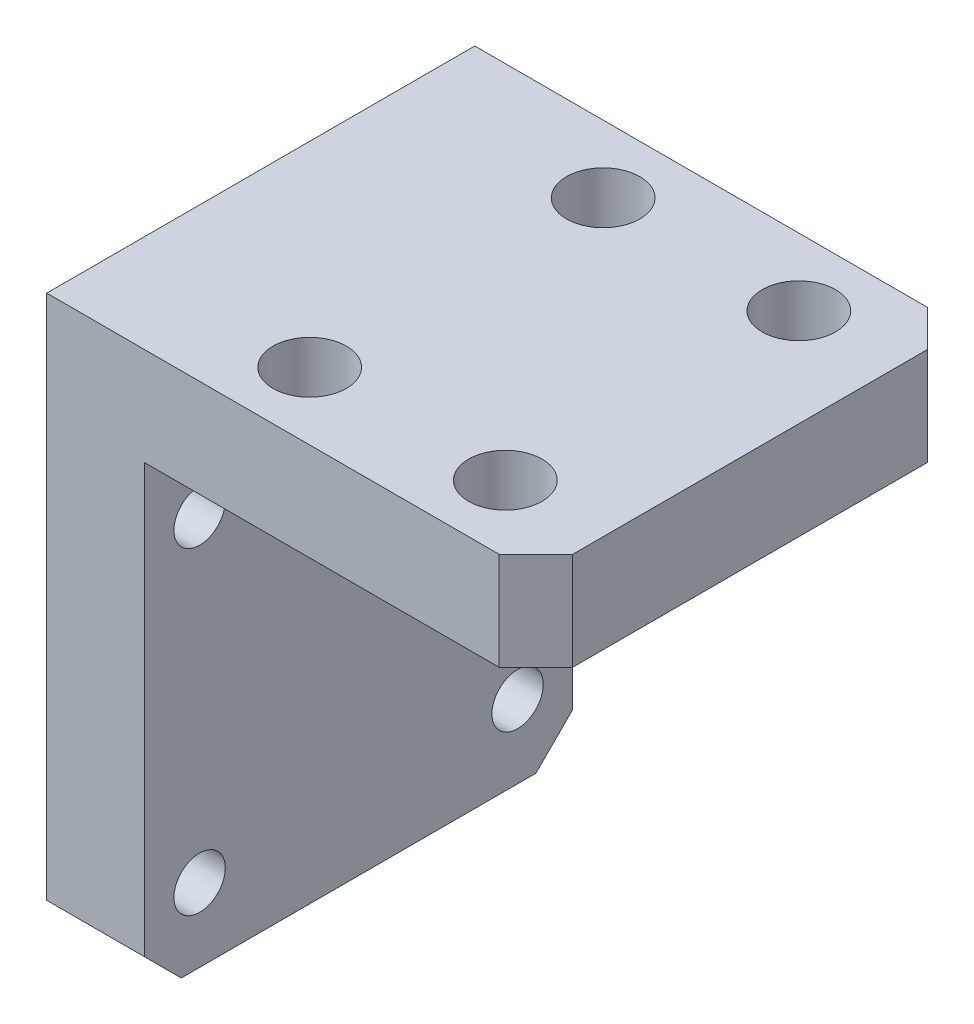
ISO-10303-21;
HEADER;
FILE_DESCRIPTION(('STEP AP214'),'2;1');
FILE_NAME('part.step','',(''),(''),'','','');
FILE_SCHEMA(('AUTOMOTIVE_DESIGN { 1 0 10303 214 1 1 1 1 }'));
ENDSEC;
DATA;
#1=APPLICATION_CONTEXT('core data for automotive mechanical design processes');
#2=APPLICATION_PROTOCOL_DEFINITION('international standard','automotive_design',2000,#1);
#3=PRODUCT_CONTEXT('',#1,'mechanical');
#4=PRODUCT('Part','Part','',(#3));
#5=PRODUCT_RELATED_PRODUCT_CATEGORY('part','',(#4));
#6=PRODUCT_DEFINITION_FORMATION('','',#4);
#7=PRODUCT_DEFINITION_CONTEXT('part definition',#1,'design');
#8=PRODUCT_DEFINITION('design','',#6,#7);
#9=PRODUCT_DEFINITION_SHAPE('','',#8);
#10=(LENGTH_UNIT() NAMED_UNIT(*) SI_UNIT(.MILLI.,.METRE.));
#11=(NAMED_UNIT(*) PLANE_ANGLE_UNIT() SI_UNIT($,.RADIAN.));
#12=(NAMED_UNIT(*) SI_UNIT($,.STERADIAN.) SOLID_ANGLE_UNIT());
#13=UNCERTAINTY_MEASURE_WITH_UNIT(LENGTH_MEASURE(1.E-05),#10,'distance_accuracy_value','');
#14=(GEOMETRIC_REPRESENTATION_CONTEXT(3) GLOBAL_UNCERTAINTY_ASSIGNED_CONTEXT((#13)) GLOBAL_UNIT_ASSIGNED_CONTEXT((#10,
#11,#12)) REPRESENTATION_CONTEXT('',''));
#15=CARTESIAN_POINT('',(0.,0.,0.));
#16=DIRECTION('',(0.,0.,1.));
#17=DIRECTION('',(1.,0.,0.));
#18=AXIS2_PLACEMENT_3D('',#15,#16,#17);
#19=CARTESIAN_POINT('',(0.,0.,35.));
#20=DIRECTION('',(-1.,0.,0.));
#21=DIRECTION('',(0.,0.,1.));
#22=AXIS2_PLACEMENT_3D('',#19,#20,#21);
#23=PLANE('',#22);
#24=DIRECTION('',(0.,0.,-1.));
#25=VECTOR('',#24,1.);
#26=CARTESIAN_POINT('',(0.,0.,35.));
#27=LINE('',#26,#25);
#28=CARTESIAN_POINT('',(0.,0.,32.));
#29=VERTEX_POINT('',#28);
#30=CARTESIAN_POINT('',(0.,0.,3.00000000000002));
#31=VERTEX_POINT('',#30);
#32=EDGE_CURVE('E151',#29,#31,#27,.T.);
#33=ORIENTED_EDGE('',*,*,#32,.T.);
#34=DIRECTION('',(0.,1.,0.));
#35=VECTOR('',#34,1.);
#36=CARTESIAN_POINT('',(0.,8.,3.00000000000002));
#37=LINE('',#36,#35);
#38=CARTESIAN_POINT('',(0.,8.,3.00000000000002));
#39=VERTEX_POINT('',#38);
#40=EDGE_CURVE('E216',#31,#39,#37,.T.);
#41=ORIENTED_EDGE('',*,*,#40,.T.);
#42=DIRECTION('',(0.,0.,-1.));
#43=VECTOR('',#42,1.);
#44=CARTESIAN_POINT('',(0.,8.,35.));
#45=LINE('',#44,#43);
#46=CARTESIAN_POINT('',(0.,8.,32.));
#47=VERTEX_POINT('',#46);
#48=EDGE_CURVE('E137',#47,#39,#45,.T.);
#49=ORIENTED_EDGE('',*,*,#48,.F.);
#50=DIRECTION('',(0.,-1.,0.));
#51=VECTOR('',#50,1.);
#52=CARTESIAN_POINT('',(0.,0.,32.));
#53=LINE('',#52,#51);
#54=EDGE_CURVE('E57',#47,#29,#53,.T.);
#55=ORIENTED_EDGE('',*,*,#54,.T.);
#56=EDGE_LOOP('',(#33,#41,#49,#55));
#57=FACE_BOUND('',#56,.T.);
#58=ADVANCED_FACE('F36',(#57),#23,.F.);
#59=CARTESIAN_POINT('',(-40.,8.,35.));
#60=DIRECTION('',(0.,-1.,0.));
#61=DIRECTION('',(0.,0.,-1.));
#62=AXIS2_PLACEMENT_3D('',#59,#60,#61);
#63=PLANE('',#62);
#64=CARTESIAN_POINT('',(-8.,8.,29.5));
#65=DIRECTION('',(0.,1.,0.));
#66=DIRECTION('',(0.,0.,-1.));
#67=AXIS2_PLACEMENT_3D('',#64,#65,#66);
#68=CIRCLE('',#67,3.);
#69=CARTESIAN_POINT('',(-8.,8.,26.5));
#70=VERTEX_POINT('',#69);
#71=EDGE_CURVE('E177',#70,#70,#68,.T.);
#72=ORIENTED_EDGE('',*,*,#71,.F.);
#73=EDGE_LOOP('',(#72));
#74=FACE_BOUND('',#73,.T.);
#75=CARTESIAN_POINT('',(-8.,8.,5.50000000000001));
#76=DIRECTION('',(0.,1.,0.));
#77=DIRECTION('',(0.,0.,1.));
#78=AXIS2_PLACEMENT_3D('',#75,#76,#77);
#79=CIRCLE('',#78,3.);
#80=CARTESIAN_POINT('',(-8.,8.,8.50000000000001));
#81=VERTEX_POINT('',#80);
#82=EDGE_CURVE('E345',#81,#81,#79,.T.);
#83=ORIENTED_EDGE('',*,*,#82,.F.);
#84=EDGE_LOOP('',(#83));
#85=FACE_BOUND('',#84,.T.);
#86=CARTESIAN_POINT('',(-24.,8.,5.5));
#87=DIRECTION('',(0.,1.,0.));
#88=DIRECTION('',(0.,0.,-1.));
#89=AXIS2_PLACEMENT_3D('',#86,#87,#88);
#90=CIRCLE('',#89,3.);
#91=CARTESIAN_POINT('',(-24.,8.,2.5));
#92=VERTEX_POINT('',#91);
#93=EDGE_CURVE('E196',#92,#92,#90,.T.);
#94=ORIENTED_EDGE('',*,*,#93,.F.);
#95=EDGE_LOOP('',(#94));
#96=FACE_BOUND('',#95,.T.);
#97=CARTESIAN_POINT('',(-24.,8.,29.5));
#98=DIRECTION('',(0.,1.,0.));
#99=DIRECTION('',(0.,0.,1.));
#100=AXIS2_PLACEMENT_3D('',#97,#98,#99);
#101=CIRCLE('',#100,3.);
#102=CARTESIAN_POINT('',(-24.,8.,32.5));
#103=VERTEX_POINT('',#102);
#104=EDGE_CURVE('E172',#103,#103,#101,.T.);
#105=ORIENTED_EDGE('',*,*,#104,.F.);
#106=EDGE_LOOP('',(#105));
#107=FACE_BOUND('',#106,.T.);
#108=ORIENTED_EDGE('',*,*,#48,.T.);
#109=DIRECTION('',(-0.707106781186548,0.,-0.707106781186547));
#110=VECTOR('',#109,1.);
#111=CARTESIAN_POINT('',(0.,8.,3.00000000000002));
#112=LINE('',#111,#110);
#113=CARTESIAN_POINT('',(-3.00000000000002,8.,0.));
#114=VERTEX_POINT('',#113);
#115=EDGE_CURVE('E221',#39,#114,#112,.T.);
#116=ORIENTED_EDGE('',*,*,#115,.T.);
#117=DIRECTION('',(-1.,0.,0.));
#118=VECTOR('',#117,1.);
#119=CARTESIAN_POINT('',(-40.,8.,0.));
#120=LINE('',#119,#118);
#121=CARTESIAN_POINT('',(-40.,8.,0.));
#122=VERTEX_POINT('',#121);
#123=EDGE_CURVE('E133',#114,#122,#120,.T.);
#124=ORIENTED_EDGE('',*,*,#123,.T.);
#125=DIRECTION('',(0.,0.,-1.));
#126=VECTOR('',#125,1.);
#127=CARTESIAN_POINT('',(-40.,8.,35.));
#128=LINE('',#127,#126);
#129=CARTESIAN_POINT('',(-40.,8.,35.));
#130=VERTEX_POINT('',#129);
#131=EDGE_CURVE('E129',#130,#122,#128,.T.);
#132=ORIENTED_EDGE('',*,*,#131,.F.);
#133=DIRECTION('',(-1.,0.,0.));
#134=VECTOR('',#133,1.);
#135=CARTESIAN_POINT('',(-40.,8.,35.));
#136=LINE('',#135,#134);
#137=CARTESIAN_POINT('',(-3.00000000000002,8.,35.));
#138=VERTEX_POINT('',#137);
#139=EDGE_CURVE('E115',#138,#130,#136,.T.);
#140=ORIENTED_EDGE('',*,*,#139,.F.);
#141=DIRECTION('',(-0.707106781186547,0.,0.707106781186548));
#142=VECTOR('',#141,1.);
#143=CARTESIAN_POINT('',(-3.00000000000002,8.,35.));
#144=LINE('',#143,#142);
#145=EDGE_CURVE('E219',#138,#47,#144,.F.);
#146=ORIENTED_EDGE('',*,*,#145,.T.);
#147=EDGE_LOOP('',(#108,#116,#124,#132,#140,#146));
#148=FACE_BOUND('',#147,.T.);
#149=ADVANCED_FACE('F131',(#74,#85,#96,#107,#148),#63,.F.);
#150=CARTESIAN_POINT('',(-40.,8.,35.));
#151=DIRECTION('',(1.,0.,0.));
#152=DIRECTION('',(0.,1.,0.));
#153=AXIS2_PLACEMENT_3D('',#150,#151,#152);
#154=PLANE('',#153);
#155=CARTESIAN_POINT('',(-40.,-6.,4.50000000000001));
#156=DIRECTION('',(-1.,0.,0.));
#157=DIRECTION('',(0.,0.,-1.));
#158=AXIS2_PLACEMENT_3D('',#155,#156,#157);
#159=CIRCLE('',#158,2.1);
#160=CARTESIAN_POINT('',(-40.,-6.,2.40000000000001));
#161=VERTEX_POINT('',#160);
#162=EDGE_CURVE('E338',#161,#161,#159,.T.);
#163=ORIENTED_EDGE('',*,*,#162,.F.);
#164=EDGE_LOOP('',(#163));
#165=FACE_BOUND('',#164,.T.);
#166=CARTESIAN_POINT('',(-40.,-6.,30.5));
#167=DIRECTION('',(-1.,0.,0.));
#168=DIRECTION('',(0.,0.,1.));
#169=AXIS2_PLACEMENT_3D('',#166,#167,#168);
#170=CIRCLE('',#169,2.1);
#171=CARTESIAN_POINT('',(-40.,-6.,32.6));
#172=VERTEX_POINT('',#171);
#173=EDGE_CURVE('E333',#172,#172,#170,.T.);
#174=ORIENTED_EDGE('',*,*,#173,.F.);
#175=EDGE_LOOP('',(#174));
#176=FACE_BOUND('',#175,.T.);
#177=CARTESIAN_POINT('',(-40.,-32.,30.5));
#178=DIRECTION('',(-1.,0.,0.));
#179=DIRECTION('',(0.,0.,-1.));
#180=AXIS2_PLACEMENT_3D('',#177,#178,#179);
#181=CIRCLE('',#180,2.1);
#182=CARTESIAN_POINT('',(-40.,-32.,28.4));
#183=VERTEX_POINT('',#182);
#184=EDGE_CURVE('E326',#183,#183,#181,.T.);
#185=ORIENTED_EDGE('',*,*,#184,.F.);
#186=EDGE_LOOP('',(#185));
#187=FACE_BOUND('',#186,.T.);
#188=CARTESIAN_POINT('',(-40.,-32.,4.50000000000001));
#189=DIRECTION('',(-1.,0.,0.));
#190=DIRECTION('',(0.,0.,1.));
#191=AXIS2_PLACEMENT_3D('',#188,#189,#190);
#192=CIRCLE('',#191,2.1);
#193=CARTESIAN_POINT('',(-40.,-32.,6.60000000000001));
#194=VERTEX_POINT('',#193);
#195=EDGE_CURVE('E187',#194,#194,#192,.T.);
#196=ORIENTED_EDGE('',*,*,#195,.F.);
#197=EDGE_LOOP('',(#196));
#198=FACE_BOUND('',#197,.T.);
#199=DIRECTION('',(0.,-1.,0.));
#200=VECTOR('',#199,1.);
#201=CARTESIAN_POINT('',(-40.,8.,0.));
#202=LINE('',#201,#200);
#203=CARTESIAN_POINT('',(-40.,-35.,0.));
#204=VERTEX_POINT('',#203);
#205=EDGE_CURVE('E153',#122,#204,#202,.T.);
#206=ORIENTED_EDGE('',*,*,#205,.T.);
#207=DIRECTION('',(0.,-0.707106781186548,0.707106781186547));
#208=VECTOR('',#207,1.);
#209=CARTESIAN_POINT('',(-40.,-38.,3.00000000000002));
#210=LINE('',#209,#208);
#211=CARTESIAN_POINT('',(-40.,-38.,3.00000000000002));
#212=VERTEX_POINT('',#211);
#213=EDGE_CURVE('E210',#204,#212,#210,.T.);
#214=ORIENTED_EDGE('',*,*,#213,.T.);
#215=DIRECTION('',(0.,0.,-1.));
#216=VECTOR('',#215,1.);
#217=CARTESIAN_POINT('',(-40.,-38.,35.));
#218=LINE('',#217,#216);
#219=CARTESIAN_POINT('',(-40.,-38.,32.));
#220=VERTEX_POINT('',#219);
#221=EDGE_CURVE('E138',#220,#212,#218,.T.);
#222=ORIENTED_EDGE('',*,*,#221,.F.);
#223=DIRECTION('',(0.,-0.707106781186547,-0.707106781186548));
#224=VECTOR('',#223,1.);
#225=CARTESIAN_POINT('',(-40.,-35.,35.));
#226=LINE('',#225,#224);
#227=CARTESIAN_POINT('',(-40.,-35.,35.));
#228=VERTEX_POINT('',#227);
#229=EDGE_CURVE('E143',#220,#228,#226,.F.);
#230=ORIENTED_EDGE('',*,*,#229,.T.);
#231=DIRECTION('',(0.,-1.,0.));
#232=VECTOR('',#231,1.);
#233=CARTESIAN_POINT('',(-40.,8.,35.));
#234=LINE('',#233,#232);
#235=EDGE_CURVE('E120',#130,#228,#234,.T.);
#236=ORIENTED_EDGE('',*,*,#235,.F.);
#237=ORIENTED_EDGE('',*,*,#131,.T.);
#238=EDGE_LOOP('',(#206,#214,#222,#230,#236,#237));
#239=FACE_BOUND('',#238,.T.);
#240=ADVANCED_FACE('F140',(#165,#176,#187,#198,#239),#154,.F.);
#241=CARTESIAN_POINT('',(-40.,-38.,35.));
#242=DIRECTION('',(0.,1.,0.));
#243=DIRECTION('',(-1.,0.,0.));
#244=AXIS2_PLACEMENT_3D('',#241,#242,#243);
#245=PLANE('',#244);
#246=ORIENTED_EDGE('',*,*,#221,.T.);
#247=DIRECTION('',(1.,0.,0.));
#248=VECTOR('',#247,1.);
#249=CARTESIAN_POINT('',(-32.,-38.,3.00000000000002));
#250=LINE('',#249,#248);
#251=CARTESIAN_POINT('',(-32.,-38.,3.00000000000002));
#252=VERTEX_POINT('',#251);
#253=EDGE_CURVE('E198',#212,#252,#250,.T.);
#254=ORIENTED_EDGE('',*,*,#253,.T.);
#255=DIRECTION('',(0.,0.,-1.));
#256=VECTOR('',#255,1.);
#257=CARTESIAN_POINT('',(-32.,-38.,35.));
#258=LINE('',#257,#256);
#259=CARTESIAN_POINT('',(-32.,-38.,32.));
#260=VERTEX_POINT('',#259);
#261=EDGE_CURVE('E163',#260,#252,#258,.T.);
#262=ORIENTED_EDGE('',*,*,#261,.F.);
#263=DIRECTION('',(-1.,0.,0.));
#264=VECTOR('',#263,1.);
#265=CARTESIAN_POINT('',(-40.,-38.,32.));
#266=LINE('',#265,#264);
#267=EDGE_CURVE('E169',#260,#220,#266,.T.);
#268=ORIENTED_EDGE('',*,*,#267,.T.);
#269=EDGE_LOOP('',(#246,#254,#262,#268));
#270=FACE_BOUND('',#269,.T.);
#271=ADVANCED_FACE('F243',(#270),#245,.F.);
#272=CARTESIAN_POINT('',(-32.,0.,35.));
#273=DIRECTION('',(-1.,0.,0.));
#274=DIRECTION('',(0.,-1.,0.));
#275=AXIS2_PLACEMENT_3D('',#272,#273,#274);
#276=PLANE('',#275);
#277=CARTESIAN_POINT('',(-32.,-6.,4.50000000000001));
#278=DIRECTION('',(-1.,0.,0.));
#279=DIRECTION('',(0.,-1.,0.));
#280=AXIS2_PLACEMENT_3D('',#277,#278,#279);
#281=CIRCLE('',#280,2.1);
#282=CARTESIAN_POINT('',(-32.,-8.1,4.50000000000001));
#283=VERTEX_POINT('',#282);
#284=EDGE_CURVE('E193',#283,#283,#281,.T.);
#285=ORIENTED_EDGE('',*,*,#284,.T.);
#286=EDGE_LOOP('',(#285));
#287=FACE_BOUND('',#286,.T.);
#288=CARTESIAN_POINT('',(-32.,-6.,30.5));
#289=DIRECTION('',(-1.,0.,0.));
#290=DIRECTION('',(0.,-1.,0.));
#291=AXIS2_PLACEMENT_3D('',#288,#289,#290);
#292=CIRCLE('',#291,2.1);
#293=CARTESIAN_POINT('',(-32.,-8.1,30.5));
#294=VERTEX_POINT('',#293);
#295=EDGE_CURVE('E190',#294,#294,#292,.T.);
#296=ORIENTED_EDGE('',*,*,#295,.T.);
#297=EDGE_LOOP('',(#296));
#298=FACE_BOUND('',#297,.T.);
#299=CARTESIAN_POINT('',(-32.,-32.,30.5));
#300=DIRECTION('',(-1.,0.,0.));
#301=DIRECTION('',(0.,-1.,0.));
#302=AXIS2_PLACEMENT_3D('',#299,#300,#301);
#303=CIRCLE('',#302,2.1);
#304=CARTESIAN_POINT('',(-32.,-34.1,30.5));
#305=VERTEX_POINT('',#304);
#306=EDGE_CURVE('E186',#305,#305,#303,.T.);
#307=ORIENTED_EDGE('',*,*,#306,.T.);
#308=EDGE_LOOP('',(#307));
#309=FACE_BOUND('',#308,.T.);
#310=CARTESIAN_POINT('',(-32.,-32.,4.50000000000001));
#311=DIRECTION('',(-1.,0.,0.));
#312=DIRECTION('',(0.,-1.,0.));
#313=AXIS2_PLACEMENT_3D('',#310,#311,#312);
#314=CIRCLE('',#313,2.1);
#315=CARTESIAN_POINT('',(-32.,-34.1,4.50000000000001));
#316=VERTEX_POINT('',#315);
#317=EDGE_CURVE('E183',#316,#316,#314,.T.);
#318=ORIENTED_EDGE('',*,*,#317,.T.);
#319=EDGE_LOOP('',(#318));
#320=FACE_BOUND('',#319,.T.);
#321=ORIENTED_EDGE('',*,*,#261,.T.);
#322=DIRECTION('',(0.,0.707106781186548,-0.707106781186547));
#323=VECTOR('',#322,1.);
#324=CARTESIAN_POINT('',(-32.,-38.,3.00000000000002));
#325=LINE('',#324,#323);
#326=CARTESIAN_POINT('',(-32.,-35.,0.));
#327=VERTEX_POINT('',#326);
#328=EDGE_CURVE('E203',#252,#327,#325,.T.);
#329=ORIENTED_EDGE('',*,*,#328,.T.);
#330=DIRECTION('',(0.,1.,0.));
#331=VECTOR('',#330,1.);
#332=CARTESIAN_POINT('',(-32.,0.,0.));
#333=LINE('',#332,#331);
#334=CARTESIAN_POINT('',(-32.,0.,0.));
#335=VERTEX_POINT('',#334);
#336=EDGE_CURVE('E156',#327,#335,#333,.T.);
#337=ORIENTED_EDGE('',*,*,#336,.T.);
#338=DIRECTION('',(0.,0.,-1.));
#339=VECTOR('',#338,1.);
#340=CARTESIAN_POINT('',(-32.,0.,35.));
#341=LINE('',#340,#339);
#342=CARTESIAN_POINT('',(-32.,0.,35.));
#343=VERTEX_POINT('',#342);
#344=EDGE_CURVE('E160',#343,#335,#341,.T.);
#345=ORIENTED_EDGE('',*,*,#344,.F.);
#346=DIRECTION('',(0.,1.,0.));
#347=VECTOR('',#346,1.);
#348=CARTESIAN_POINT('',(-32.,0.,35.));
#349=LINE('',#348,#347);
#350=CARTESIAN_POINT('',(-32.,-35.,35.));
#351=VERTEX_POINT('',#350);
#352=EDGE_CURVE('E144',#351,#343,#349,.T.);
#353=ORIENTED_EDGE('',*,*,#352,.F.);
#354=DIRECTION('',(0.,0.707106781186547,0.707106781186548));
#355=VECTOR('',#354,1.);
#356=CARTESIAN_POINT('',(-32.,-35.,35.));
#357=LINE('',#356,#355);
#358=EDGE_CURVE('E201',#351,#260,#357,.F.);
#359=ORIENTED_EDGE('',*,*,#358,.T.);
#360=EDGE_LOOP('',(#321,#329,#337,#345,#353,#359));
#361=FACE_BOUND('',#360,.T.);
#362=ADVANCED_FACE('F246',(#287,#298,#309,#320,#361),#276,.F.);
#363=CARTESIAN_POINT('',(-32.,0.,35.));
#364=DIRECTION('',(0.,1.,0.));
#365=DIRECTION('',(0.,0.,1.));
#366=AXIS2_PLACEMENT_3D('',#363,#364,#365);
#367=PLANE('',#366);
#368=CARTESIAN_POINT('',(-8.,0.,29.5));
#369=DIRECTION('',(0.,1.,0.));
#370=DIRECTION('',(0.,0.,1.));
#371=AXIS2_PLACEMENT_3D('',#368,#369,#370);
#372=CIRCLE('',#371,3.);
#373=CARTESIAN_POINT('',(-8.,0.,32.5));
#374=VERTEX_POINT('',#373);
#375=EDGE_CURVE('E180',#374,#374,#372,.T.);
#376=ORIENTED_EDGE('',*,*,#375,.T.);
#377=EDGE_LOOP('',(#376));
#378=FACE_BOUND('',#377,.T.);
#379=CARTESIAN_POINT('',(-8.,0.,5.50000000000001));
#380=DIRECTION('',(0.,1.,0.));
#381=DIRECTION('',(0.,0.,1.));
#382=AXIS2_PLACEMENT_3D('',#379,#380,#381);
#383=CIRCLE('',#382,3.);
#384=CARTESIAN_POINT('',(-8.,0.,8.50000000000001));
#385=VERTEX_POINT('',#384);
#386=EDGE_CURVE('E176',#385,#385,#383,.T.);
#387=ORIENTED_EDGE('',*,*,#386,.T.);
#388=EDGE_LOOP('',(#387));
#389=FACE_BOUND('',#388,.T.);
#390=CARTESIAN_POINT('',(-24.,0.,5.5));
#391=DIRECTION('',(0.,1.,0.));
#392=DIRECTION('',(0.,0.,1.));
#393=AXIS2_PLACEMENT_3D('',#390,#391,#392);
#394=CIRCLE('',#393,3.);
#395=CARTESIAN_POINT('',(-24.,0.,8.5));
#396=VERTEX_POINT('',#395);
#397=EDGE_CURVE('E173',#396,#396,#394,.T.);
#398=ORIENTED_EDGE('',*,*,#397,.T.);
#399=EDGE_LOOP('',(#398));
#400=FACE_BOUND('',#399,.T.);
#401=CARTESIAN_POINT('',(-24.,0.,29.5));
#402=DIRECTION('',(0.,1.,0.));
#403=DIRECTION('',(0.,0.,1.));
#404=AXIS2_PLACEMENT_3D('',#401,#402,#403);
#405=CIRCLE('',#404,3.);
#406=CARTESIAN_POINT('',(-24.,0.,32.5));
#407=VERTEX_POINT('',#406);
#408=EDGE_CURVE('E154',#407,#407,#405,.T.);
#409=ORIENTED_EDGE('',*,*,#408,.T.);
#410=EDGE_LOOP('',(#409));
#411=FACE_BOUND('',#410,.T.);
#412=DIRECTION('',(1.,0.,0.));
#413=VECTOR('',#412,1.);
#414=CARTESIAN_POINT('',(-32.,0.,0.));
#415=LINE('',#414,#413);
#416=CARTESIAN_POINT('',(-3.00000000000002,0.,0.));
#417=VERTEX_POINT('',#416);
#418=EDGE_CURVE('E126',#335,#417,#415,.T.);
#419=ORIENTED_EDGE('',*,*,#418,.T.);
#420=DIRECTION('',(0.707106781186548,0.,0.707106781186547));
#421=VECTOR('',#420,1.);
#422=CARTESIAN_POINT('',(0.,0.,3.00000000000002));
#423=LINE('',#422,#421);
#424=EDGE_CURVE('E11',#417,#31,#423,.T.);
#425=ORIENTED_EDGE('',*,*,#424,.T.);
#426=ORIENTED_EDGE('',*,*,#32,.F.);
#427=DIRECTION('',(0.707106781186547,0.,-0.707106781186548));
#428=VECTOR('',#427,1.);
#429=CARTESIAN_POINT('',(-3.00000000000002,0.,35.));
#430=LINE('',#429,#428);
#431=CARTESIAN_POINT('',(-3.00000000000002,0.,35.));
#432=VERTEX_POINT('',#431);
#433=EDGE_CURVE('E45',#29,#432,#430,.F.);
#434=ORIENTED_EDGE('',*,*,#433,.T.);
#435=DIRECTION('',(1.,0.,0.));
#436=VECTOR('',#435,1.);
#437=CARTESIAN_POINT('',(-32.,0.,35.));
#438=LINE('',#437,#436);
#439=EDGE_CURVE('E146',#343,#432,#438,.T.);
#440=ORIENTED_EDGE('',*,*,#439,.F.);
#441=ORIENTED_EDGE('',*,*,#344,.T.);
#442=EDGE_LOOP('',(#419,#425,#426,#434,#440,#441));
#443=FACE_BOUND('',#442,.T.);
#444=ADVANCED_FACE('F224',(#378,#389,#400,#411,#443),#367,.F.);
#445=CARTESIAN_POINT('',(0.,0.,35.));
#446=DIRECTION('',(0.,0.,-1.));
#447=DIRECTION('',(-1.,0.,0.));
#448=AXIS2_PLACEMENT_3D('',#445,#446,#447);
#449=PLANE('',#448);
#450=ORIENTED_EDGE('',*,*,#235,.T.);
#451=DIRECTION('',(1.,0.,0.));
#452=VECTOR('',#451,1.);
#453=CARTESIAN_POINT('',(0.,-34.9999999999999,35.));
#454=LINE('',#453,#452);
#455=EDGE_CURVE('E213',#228,#351,#454,.T.);
#456=ORIENTED_EDGE('',*,*,#455,.T.);
#457=ORIENTED_EDGE('',*,*,#352,.T.);
#458=ORIENTED_EDGE('',*,*,#439,.T.);
#459=DIRECTION('',(0.,1.,0.));
#460=VECTOR('',#459,1.);
#461=CARTESIAN_POINT('',(-3.00000000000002,0.,35.));
#462=LINE('',#461,#460);
#463=EDGE_CURVE('E124',#432,#138,#462,.T.);
#464=ORIENTED_EDGE('',*,*,#463,.T.);
#465=ORIENTED_EDGE('',*,*,#139,.T.);
#466=EDGE_LOOP('',(#450,#456,#457,#458,#464,#465));
#467=FACE_BOUND('',#466,.T.);
#468=ADVANCED_FACE('F117',(#467),#449,.F.);
#469=CARTESIAN_POINT('',(0.,0.,0.));
#470=DIRECTION('',(0.,0.,-1.));
#471=DIRECTION('',(-1.,0.,0.));
#472=AXIS2_PLACEMENT_3D('',#469,#470,#471);
#473=PLANE('',#472);
#474=ORIENTED_EDGE('',*,*,#336,.F.);
#475=DIRECTION('',(-1.,0.,0.));
#476=VECTOR('',#475,1.);
#477=CARTESIAN_POINT('',(-40.,-35.,0.));
#478=LINE('',#477,#476);
#479=EDGE_CURVE('E207',#327,#204,#478,.T.);
#480=ORIENTED_EDGE('',*,*,#479,.T.);
#481=ORIENTED_EDGE('',*,*,#205,.F.);
#482=ORIENTED_EDGE('',*,*,#123,.F.);
#483=DIRECTION('',(0.,-1.,0.));
#484=VECTOR('',#483,1.);
#485=CARTESIAN_POINT('',(-3.00000000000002,0.,0.));
#486=LINE('',#485,#484);
#487=EDGE_CURVE('E205',#114,#417,#486,.T.);
#488=ORIENTED_EDGE('',*,*,#487,.T.);
#489=ORIENTED_EDGE('',*,*,#418,.F.);
#490=EDGE_LOOP('',(#474,#480,#481,#482,#488,#489));
#491=FACE_BOUND('',#490,.T.);
#492=ADVANCED_FACE('F234',(#491),#473,.T.);
#493=CARTESIAN_POINT('',(-24.,-38.,29.5));
#494=DIRECTION('',(0.,1.,0.));
#495=DIRECTION('',(0.,0.,1.));
#496=AXIS2_PLACEMENT_3D('',#493,#494,#495);
#497=CYLINDRICAL_SURFACE('',#496,3.);
#498=ORIENTED_EDGE('',*,*,#104,.T.);
#499=EDGE_LOOP('',(#498));
#500=FACE_BOUND('',#499,.T.);
#501=ORIENTED_EDGE('',*,*,#408,.F.);
#502=EDGE_LOOP('',(#501));
#503=FACE_BOUND('',#502,.T.);
#504=ADVANCED_FACE('F289',(#500,#503),#497,.F.);
#505=CARTESIAN_POINT('',(-24.,-38.,5.5));
#506=DIRECTION('',(0.,1.,0.));
#507=DIRECTION('',(0.,0.,1.));
#508=AXIS2_PLACEMENT_3D('',#505,#506,#507);
#509=CYLINDRICAL_SURFACE('',#508,3.);
#510=ORIENTED_EDGE('',*,*,#93,.T.);
#511=EDGE_LOOP('',(#510));
#512=FACE_BOUND('',#511,.T.);
#513=ORIENTED_EDGE('',*,*,#397,.F.);
#514=EDGE_LOOP('',(#513));
#515=FACE_BOUND('',#514,.T.);
#516=ADVANCED_FACE('F294',(#512,#515),#509,.F.);
#517=CARTESIAN_POINT('',(-8.,-38.,5.50000000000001));
#518=DIRECTION('',(0.,1.,0.));
#519=DIRECTION('',(0.,0.,1.));
#520=AXIS2_PLACEMENT_3D('',#517,#518,#519);
#521=CYLINDRICAL_SURFACE('',#520,3.);
#522=ORIENTED_EDGE('',*,*,#82,.T.);
#523=EDGE_LOOP('',(#522));
#524=FACE_BOUND('',#523,.T.);
#525=ORIENTED_EDGE('',*,*,#386,.F.);
#526=EDGE_LOOP('',(#525));
#527=FACE_BOUND('',#526,.T.);
#528=ADVANCED_FACE('F298',(#524,#527),#521,.F.);
#529=CARTESIAN_POINT('',(-8.,-38.,29.5));
#530=DIRECTION('',(0.,1.,0.));
#531=DIRECTION('',(0.,0.,1.));
#532=AXIS2_PLACEMENT_3D('',#529,#530,#531);
#533=CYLINDRICAL_SURFACE('',#532,3.);
#534=ORIENTED_EDGE('',*,*,#71,.T.);
#535=EDGE_LOOP('',(#534));
#536=FACE_BOUND('',#535,.T.);
#537=ORIENTED_EDGE('',*,*,#375,.F.);
#538=EDGE_LOOP('',(#537));
#539=FACE_BOUND('',#538,.T.);
#540=ADVANCED_FACE('F302',(#536,#539),#533,.F.);
#541=CARTESIAN_POINT('',(0.,-32.,4.50000000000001));
#542=DIRECTION('',(-1.,0.,0.));
#543=DIRECTION('',(0.,0.,1.));
#544=AXIS2_PLACEMENT_3D('',#541,#542,#543);
#545=CYLINDRICAL_SURFACE('',#544,2.1);
#546=ORIENTED_EDGE('',*,*,#195,.T.);
#547=EDGE_LOOP('',(#546));
#548=FACE_BOUND('',#547,.T.);
#549=ORIENTED_EDGE('',*,*,#317,.F.);
#550=EDGE_LOOP('',(#549));
#551=FACE_BOUND('',#550,.T.);
#552=ADVANCED_FACE('F306',(#548,#551),#545,.F.);
#553=CARTESIAN_POINT('',(0.,-32.,30.5));
#554=DIRECTION('',(-1.,0.,0.));
#555=DIRECTION('',(0.,0.,1.));
#556=AXIS2_PLACEMENT_3D('',#553,#554,#555);
#557=CYLINDRICAL_SURFACE('',#556,2.1);
#558=ORIENTED_EDGE('',*,*,#184,.T.);
#559=EDGE_LOOP('',(#558));
#560=FACE_BOUND('',#559,.T.);
#561=ORIENTED_EDGE('',*,*,#306,.F.);
#562=EDGE_LOOP('',(#561));
#563=FACE_BOUND('',#562,.T.);
#564=ADVANCED_FACE('F310',(#560,#563),#557,.F.);
#565=CARTESIAN_POINT('',(0.,-6.,30.5));
#566=DIRECTION('',(-1.,0.,0.));
#567=DIRECTION('',(0.,0.,1.));
#568=AXIS2_PLACEMENT_3D('',#565,#566,#567);
#569=CYLINDRICAL_SURFACE('',#568,2.1);
#570=ORIENTED_EDGE('',*,*,#173,.T.);
#571=EDGE_LOOP('',(#570));
#572=FACE_BOUND('',#571,.T.);
#573=ORIENTED_EDGE('',*,*,#295,.F.);
#574=EDGE_LOOP('',(#573));
#575=FACE_BOUND('',#574,.T.);
#576=ADVANCED_FACE('F314',(#572,#575),#569,.F.);
#577=CARTESIAN_POINT('',(0.,-6.,4.50000000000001));
#578=DIRECTION('',(-1.,0.,0.));
#579=DIRECTION('',(0.,0.,1.));
#580=AXIS2_PLACEMENT_3D('',#577,#578,#579);
#581=CYLINDRICAL_SURFACE('',#580,2.1);
#582=ORIENTED_EDGE('',*,*,#162,.T.);
#583=EDGE_LOOP('',(#582));
#584=FACE_BOUND('',#583,.T.);
#585=ORIENTED_EDGE('',*,*,#284,.F.);
#586=EDGE_LOOP('',(#585));
#587=FACE_BOUND('',#586,.T.);
#588=ADVANCED_FACE('F255',(#584,#587),#581,.F.);
#589=CARTESIAN_POINT('',(-40.,-38.,3.00000000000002));
#590=DIRECTION('',(0.,-0.707106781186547,-0.707106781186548));
#591=DIRECTION('',(-1.,0.,0.));
#592=AXIS2_PLACEMENT_3D('',#589,#590,#591);
#593=PLANE('',#592);
#594=ORIENTED_EDGE('',*,*,#213,.F.);
#595=ORIENTED_EDGE('',*,*,#479,.F.);
#596=ORIENTED_EDGE('',*,*,#328,.F.);
#597=ORIENTED_EDGE('',*,*,#253,.F.);
#598=EDGE_LOOP('',(#594,#595,#596,#597));
#599=FACE_BOUND('',#598,.T.);
#600=ADVANCED_FACE('F240',(#599),#593,.T.);
#601=CARTESIAN_POINT('',(0.,-34.9999999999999,35.));
#602=DIRECTION('',(0.,0.707106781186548,-0.707106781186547));
#603=DIRECTION('',(1.,0.,0.));
#604=AXIS2_PLACEMENT_3D('',#601,#602,#603);
#605=PLANE('',#604);
#606=ORIENTED_EDGE('',*,*,#229,.F.);
#607=ORIENTED_EDGE('',*,*,#267,.F.);
#608=ORIENTED_EDGE('',*,*,#358,.F.);
#609=ORIENTED_EDGE('',*,*,#455,.F.);
#610=EDGE_LOOP('',(#606,#607,#608,#609));
#611=FACE_BOUND('',#610,.T.);
#612=ADVANCED_FACE('F248',(#611),#605,.F.);
#613=CARTESIAN_POINT('',(0.,0.,3.00000000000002));
#614=DIRECTION('',(0.707106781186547,0.,-0.707106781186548));
#615=DIRECTION('',(0.,-1.,0.));
#616=AXIS2_PLACEMENT_3D('',#613,#614,#615);
#617=PLANE('',#616);
#618=ORIENTED_EDGE('',*,*,#424,.F.);
#619=ORIENTED_EDGE('',*,*,#487,.F.);
#620=ORIENTED_EDGE('',*,*,#115,.F.);
#621=ORIENTED_EDGE('',*,*,#40,.F.);
#622=EDGE_LOOP('',(#618,#619,#620,#621));
#623=FACE_BOUND('',#622,.T.);
#624=ADVANCED_FACE('F230',(#623),#617,.T.);
#625=CARTESIAN_POINT('',(-3.00000000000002,0.,35.));
#626=DIRECTION('',(-0.707106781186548,0.,-0.707106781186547));
#627=DIRECTION('',(0.,1.,0.));
#628=AXIS2_PLACEMENT_3D('',#625,#626,#627);
#629=PLANE('',#628);
#630=ORIENTED_EDGE('',*,*,#433,.F.);
#631=ORIENTED_EDGE('',*,*,#54,.F.);
#632=ORIENTED_EDGE('',*,*,#145,.F.);
#633=ORIENTED_EDGE('',*,*,#463,.F.);
#634=EDGE_LOOP('',(#630,#631,#632,#633));
#635=FACE_BOUND('',#634,.T.);
#636=ADVANCED_FACE('F39',(#635),#629,.F.);
#637=CLOSED_SHELL('',(#58,#149,#240,#271,#362,#444,#468,#492,#504,#516,#528,#540,#552,#564,#576,
#588,#600,#612,#624,#636));
#638=MANIFOLD_SOLID_BREP('B2',#637);
#639=ADVANCED_BREP_SHAPE_REPRESENTATION('',(#18,#638),#14);
#640=SHAPE_DEFINITION_REPRESENTATION(#9,#639);
ENDSEC;
END-ISO-10303-21;
